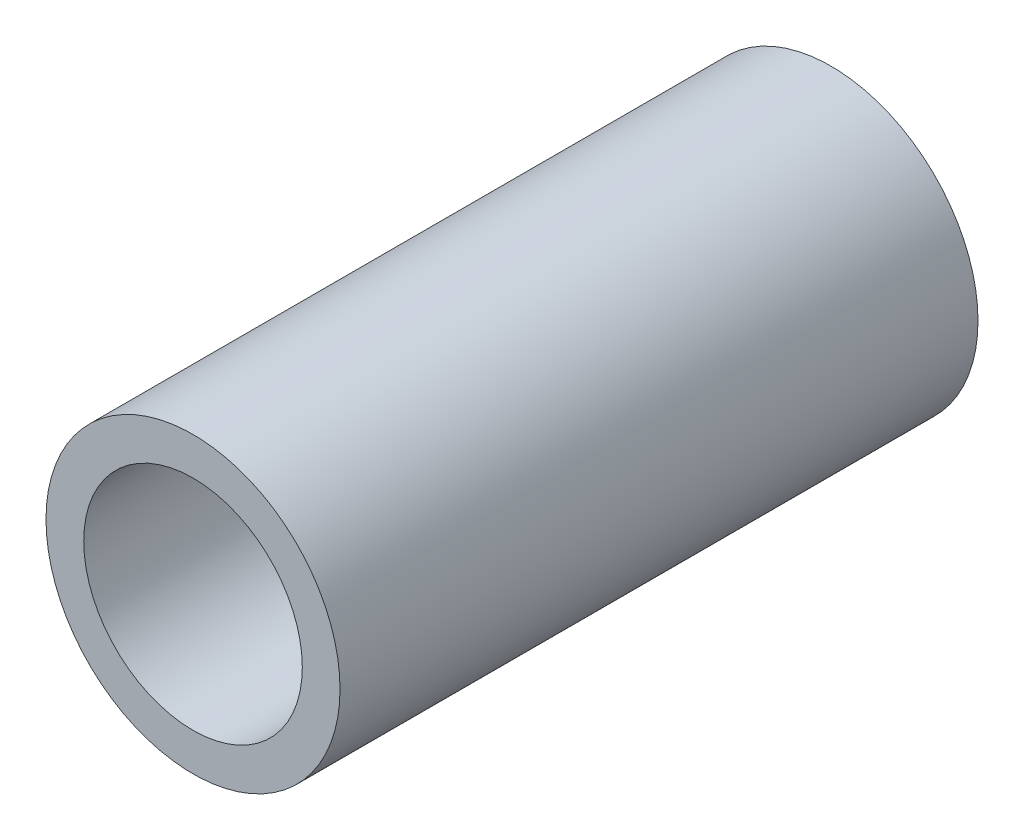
from build123d import *

# Parameters (mm, degrees)
SKETCH1_R           = 6.731
SKETCH1_R_2         = 5.0038
BOSS_EXTRUDE1_DEPTH = 29.21


with BuildPart() as part:
    # Sketch1 → Boss-Extrude1 (new body)
    with BuildSketch(Plane.XY):
        with Locations(Location((0, 0, 0), (0, 0, 180))):
            Circle(SKETCH1_R)
        with Locations(Location((0, 0, 0), (0, 0, 180))):
            Circle(SKETCH1_R_2, mode=Mode.SUBTRACT)
    extrude(amount=BOSS_EXTRUDE1_DEPTH)


solid = part.part
